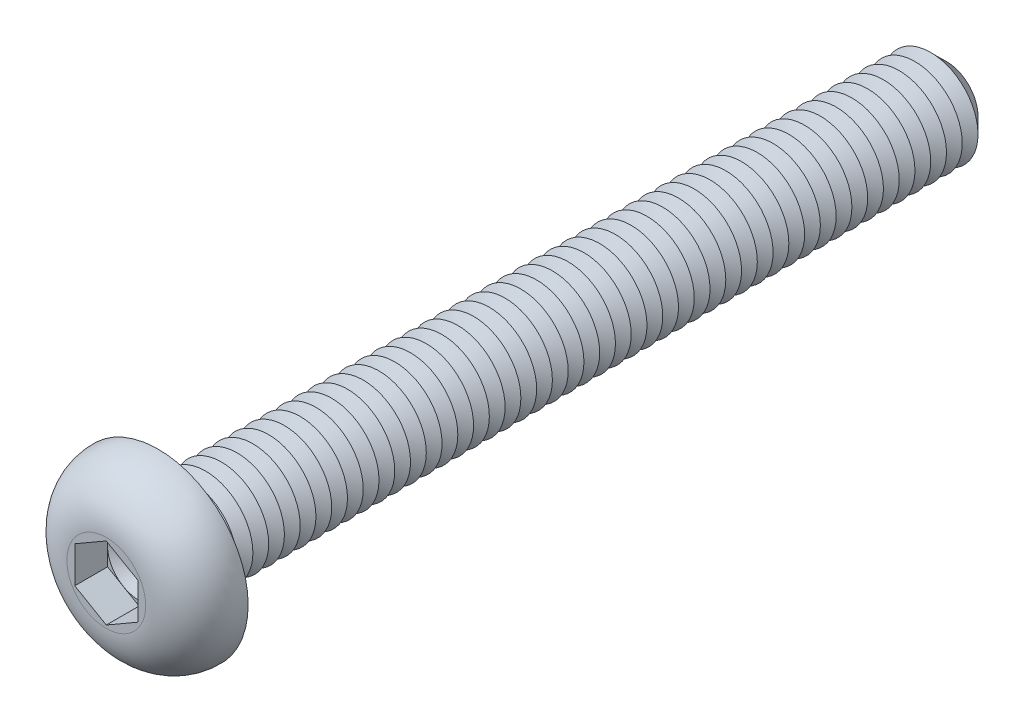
from build123d import *

# Parameters (mm, degrees)
CUT_EXTRUDE1_DEPTH  = 1.04
SKETCH4_R           = 1.5
BOSS_EXTRUDE1_DEPTH = 25
CHAMFER1_SIZE       = 0.5
LPATTERN1_COUNT     = 48
LPATTERN1_PITCH     = 0.5
FILLET2_R           = 0.2


with BuildPart() as part:
    # Sketch2 → Revolve1 (revolve)
    with BuildSketch(Plane(origin=(0, 0, 0), x_dir=(0, 0, -1), z_dir=(1, 0, 0)), mode=Mode.PRIVATE) as revolve1_sk:
        with BuildLine():
            Line((0, 0), (-1.65, 0))
            Line((-1.65, 0), (-1.65, 1.250781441))
            ThreePointArc((-1.65, 1.250781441), (-1.163552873, 2.39969397), (0, 2.85))
            Line((0, 2.85), (0, 0))
        make_face()
    revolve(revolve1_sk.sketch.rotate(Axis((0, 0, 47.934239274), (0, 0, -1)), 90), axis=Axis((0, 0, 47.934239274), (0, 0, -1)))

    # Sketch3 → Cut-Extrude1 (cut)
    with BuildSketch(Plane.XY.offset(1.65)):
        Polygon((0, 1.154700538), (-1, 0.577350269), (-1, -0.577350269), (0, -1.154700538), (1, -0.577350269), (1, 0.577350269), align=None)
    extrude(amount=-CUT_EXTRUDE1_DEPTH, mode=Mode.SUBTRACT)

    # Sketch4 → Boss-Extrude1 (add)
    with BuildSketch(Plane(origin=(0, 0, 0), x_dir=(-1, 0, 0), z_dir=(0, 0, -1))):
        with Locations(Location((0, 0, 0), (0, 0, 180))):
            Circle(SKETCH4_R)
    extrude(amount=BOSS_EXTRUDE1_DEPTH)

    # Chamfer1
    chamfer1_edges = [part.edges().sort_by_distance(p)[0] for p in [
        (-1.5, 0, -25),
    ]]
    chamfer(chamfer1_edges, length=CHAMFER1_SIZE)

    # Sketch5 → Cut-Revolve1 (revolve, cut)
    with BuildSketch(Plane(origin=(0, 0, 0), x_dir=(0, 0, -1), z_dir=(1, 0, 0)), mode=Mode.PRIVATE) as cut_revolve1_sk:
        Polygon((0.5, 1.5), (1, 1.5), (0.75, 1.066987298), align=None)
    cut_revolve1 = revolve(cut_revolve1_sk.sketch.rotate(Axis((0, 0, 47.934239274), (0, 0, -1)), 90), axis=Axis((0, 0, 47.934239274), (0, 0, -1)), mode=Mode.SUBTRACT)

    # LPattern1: Cut-Revolve1 ×48
    with Locations(*[(0, 0, -i * LPATTERN1_PITCH) for i in range(1, LPATTERN1_COUNT)]):
        add(cut_revolve1, mode=Mode.SUBTRACT)

    # Fillet2
    fillet2_edges = [part.edges().sort_by_distance(p)[0] for p in [
        (-1.5, 0, 0),
    ]]
    fillet(fillet2_edges, radius=FILLET2_R)

    # Cut-Extrude2 cone 1 section (on through the dimple's axis) → Cut-Extrude2 (revolve, cut)
    with BuildSketch(Plane(origin=(0, 0, 0.61), x_dir=(0, -1, 0), z_dir=(1, 0, 0))):
        Polygon((0, 0), (1, 0), (0, 0.577350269), align=None)
    revolve(axis=Axis((0, 0, 0.61), (0, 0, -1)), mode=Mode.SUBTRACT)


solid = part.part
